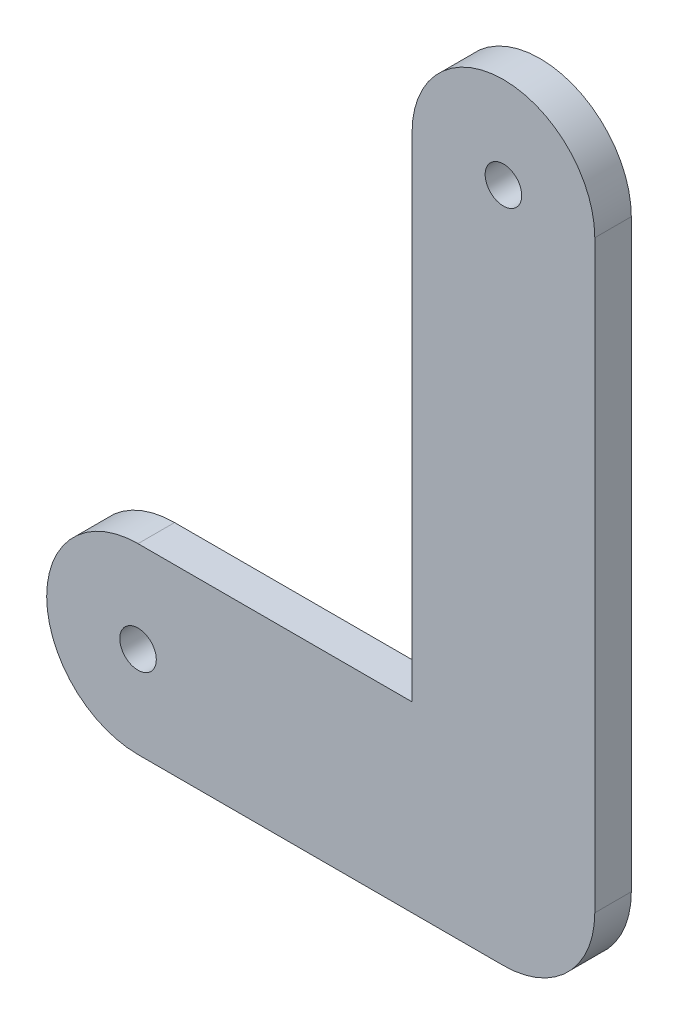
from build123d import *

# Parameters (mm, degrees)
BOSS_EXTRU_1_DEPTH      = 10
ESQUISSE2_R             = 5
ENL_V_MAT_EXTRU_1_DEPTH = 224.494966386


with BuildPart() as part:
    # Esquisse1 → Boss.-Extru.1 (new body)
    with BuildSketch(Plane.XY):
        with BuildLine():
            Line((-100, -25), (0, -25))
            ThreePointArc((0, -25), (-17.67766953, -17.67766953), (-25, 0))
            Line((-25, 0), (-25, 25))
            Line((-25, 25), (-100, 25))
            ThreePointArc((-100, 25), (-125, 0), (-100, -25))
        make_face()
        with BuildLine():
            ThreePointArc((-25, 0), (-17.67766953, -17.67766953), (0, -25))
            ThreePointArc((0, -25), (17.67766953, -17.67766953), (25, 0))
            ThreePointArc((25, 0), (17.67766953, 17.67766953), (0, 25))
            Line((0, 25), (-25, 25))
            Line((-25, 25), (-25, 0))
        make_face()
        with BuildLine():
            ThreePointArc((0, 25), (17.67766953, 17.67766953), (25, 0))
            Line((25, 0), (25, 160))
            ThreePointArc((25, 160), (0, 185), (-25, 160))
            Line((-25, 160), (-25, 25))
            Line((-25, 25), (0, 25))
        make_face()
    extrude(amount=BOSS_EXTRU_1_DEPTH)

    # Esquisse2 → Enl_v. mat.-Extru.1 (cut, through all)
    with BuildSketch(Plane.XY.offset(10)):
        with Locations((-100, 0)):
            Circle(ESQUISSE2_R)
        with Locations((0, 160)):
            Circle(ESQUISSE2_R)
    extrude(amount=-ENL_V_MAT_EXTRU_1_DEPTH, mode=Mode.SUBTRACT)


solid = part.part
